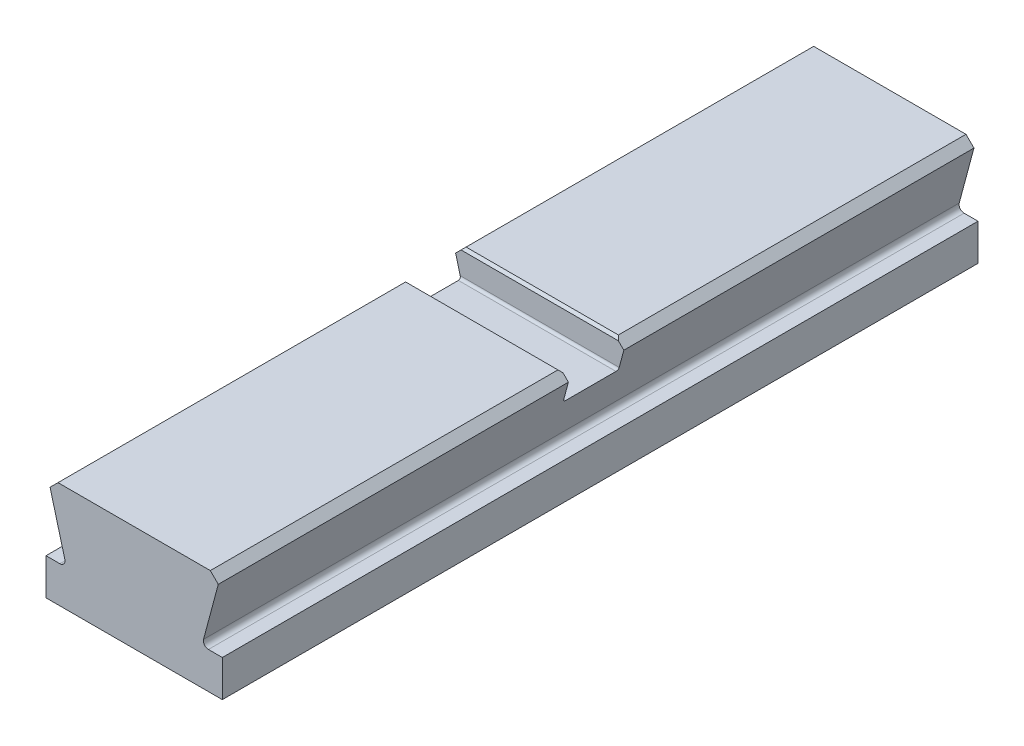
ISO-10303-21;
HEADER;
FILE_DESCRIPTION(('STEP AP214'),'2;1');
FILE_NAME('part.step','',(''),(''),'','','');
FILE_SCHEMA(('AUTOMOTIVE_DESIGN { 1 0 10303 214 1 1 1 1 }'));
ENDSEC;
DATA;
#1=APPLICATION_CONTEXT('core data for automotive mechanical design processes');
#2=APPLICATION_PROTOCOL_DEFINITION('international standard','automotive_design',2000,#1);
#3=PRODUCT_CONTEXT('',#1,'mechanical');
#4=PRODUCT('Part','Part','',(#3));
#5=PRODUCT_RELATED_PRODUCT_CATEGORY('part','',(#4));
#6=PRODUCT_DEFINITION_FORMATION('','',#4);
#7=PRODUCT_DEFINITION_CONTEXT('part definition',#1,'design');
#8=PRODUCT_DEFINITION('design','',#6,#7);
#9=PRODUCT_DEFINITION_SHAPE('','',#8);
#10=(LENGTH_UNIT() NAMED_UNIT(*) SI_UNIT(.MILLI.,.METRE.));
#11=(NAMED_UNIT(*) PLANE_ANGLE_UNIT() SI_UNIT($,.RADIAN.));
#12=(NAMED_UNIT(*) SI_UNIT($,.STERADIAN.) SOLID_ANGLE_UNIT());
#13=UNCERTAINTY_MEASURE_WITH_UNIT(LENGTH_MEASURE(1.E-05),#10,'distance_accuracy_value','');
#14=(GEOMETRIC_REPRESENTATION_CONTEXT(3) GLOBAL_UNCERTAINTY_ASSIGNED_CONTEXT((#13)) GLOBAL_UNIT_ASSIGNED_CONTEXT((#10,
#11,#12)) REPRESENTATION_CONTEXT('',''));
#15=CARTESIAN_POINT('',(0.,0.,0.));
#16=DIRECTION('',(0.,0.,1.));
#17=DIRECTION('',(1.,0.,0.));
#18=AXIS2_PLACEMENT_3D('',#15,#16,#17);
#19=CARTESIAN_POINT('',(-34.2346281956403,0.,-150.));
#20=DIRECTION('',(0.,1.,0.));
#21=DIRECTION('',(-1.,0.,0.));
#22=AXIS2_PLACEMENT_3D('',#19,#20,#21);
#23=PLANE('',#22);
#24=DIRECTION('',(-1.,0.,0.));
#25=VECTOR('',#24,1.);
#26=CARTESIAN_POINT('',(-34.2346281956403,0.,12.));
#27=LINE('',#26,#25);
#28=CARTESIAN_POINT('',(30.2346281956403,0.,12.));
#29=VERTEX_POINT('',#28);
#30=CARTESIAN_POINT('',(-30.2346281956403,0.,12.));
#31=VERTEX_POINT('',#30);
#32=EDGE_CURVE('E286',#29,#31,#27,.T.);
#33=ORIENTED_EDGE('',*,*,#32,.T.);
#34=DIRECTION('',(0.,0.,1.));
#35=VECTOR('',#34,1.);
#36=CARTESIAN_POINT('',(-30.2346281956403,0.,-150.));
#37=LINE('',#36,#35);
#38=CARTESIAN_POINT('',(-30.2346281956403,0.,150.));
#39=VERTEX_POINT('',#38);
#40=EDGE_CURVE('E336',#31,#39,#37,.T.);
#41=ORIENTED_EDGE('',*,*,#40,.T.);
#42=DIRECTION('',(-1.,0.,0.));
#43=VECTOR('',#42,1.);
#44=CARTESIAN_POINT('',(-34.2346281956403,0.,150.));
#45=LINE('',#44,#43);
#46=CARTESIAN_POINT('',(30.2346281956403,0.,150.));
#47=VERTEX_POINT('',#46);
#48=EDGE_CURVE('E224',#47,#39,#45,.T.);
#49=ORIENTED_EDGE('',*,*,#48,.F.);
#50=DIRECTION('',(0.,0.,-1.));
#51=VECTOR('',#50,1.);
#52=CARTESIAN_POINT('',(30.2346281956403,0.,-150.));
#53=LINE('',#52,#51);
#54=EDGE_CURVE('E334',#47,#29,#53,.T.);
#55=ORIENTED_EDGE('',*,*,#54,.T.);
#56=EDGE_LOOP('',(#33,#41,#49,#55));
#57=FACE_BOUND('',#56,.T.);
#58=ADVANCED_FACE('F35',(#57),#23,.T.);
#59=CARTESIAN_POINT('',(-34.2346281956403,0.,-150.));
#60=DIRECTION('',(-0.965925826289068,-0.25881904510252,0.));
#61=DIRECTION('',(0.25881904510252,-0.965925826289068,0.));
#62=AXIS2_PLACEMENT_3D('',#59,#60,#61);
#63=PLANE('',#62);
#64=DIRECTION('',(0.25881904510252,-0.965925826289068,0.));
#65=VECTOR('',#64,1.);
#66=CARTESIAN_POINT('',(-34.2346281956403,0.,-11.));
#67=LINE('',#66,#65);
#68=CARTESIAN_POINT('',(-33.3893287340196,-3.15470053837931,-11.));
#69=VERTEX_POINT('',#68);
#70=CARTESIAN_POINT('',(-31.5551362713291,-10.,-11.));
#71=VERTEX_POINT('',#70);
#72=EDGE_CURVE('E370',#69,#71,#67,.T.);
#73=ORIENTED_EDGE('',*,*,#72,.F.);
#74=DIRECTION('',(0.,0.,-1.));
#75=VECTOR('',#74,1.);
#76=CARTESIAN_POINT('',(-33.3893287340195,-3.1547005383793,-150.));
#77=LINE('',#76,#75);
#78=CARTESIAN_POINT('',(-33.3893287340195,-3.1547005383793,-150.));
#79=VERTEX_POINT('',#78);
#80=EDGE_CURVE('E332',#69,#79,#77,.T.);
#81=ORIENTED_EDGE('',*,*,#80,.T.);
#82=DIRECTION('',(0.25881904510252,-0.965925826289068,0.));
#83=VECTOR('',#82,1.);
#84=CARTESIAN_POINT('',(-34.2346281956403,0.,-150.));
#85=LINE('',#84,#83);
#86=CARTESIAN_POINT('',(-27.5406244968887,-24.982361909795,-150.));
#87=VERTEX_POINT('',#86);
#88=EDGE_CURVE('E226',#79,#87,#85,.T.);
#89=ORIENTED_EDGE('',*,*,#88,.T.);
#90=DIRECTION('',(0.,0.,1.));
#91=VECTOR('',#90,1.);
#92=CARTESIAN_POINT('',(-27.5406244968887,-24.982361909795,150.));
#93=LINE('',#92,#91);
#94=CARTESIAN_POINT('',(-27.5406244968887,-24.982361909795,150.));
#95=VERTEX_POINT('',#94);
#96=EDGE_CURVE('E289',#87,#95,#93,.T.);
#97=ORIENTED_EDGE('',*,*,#96,.T.);
#98=DIRECTION('',(0.25881904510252,-0.965925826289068,0.));
#99=VECTOR('',#98,1.);
#100=CARTESIAN_POINT('',(-34.2346281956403,0.,150.));
#101=LINE('',#100,#99);
#102=CARTESIAN_POINT('',(-33.3893287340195,-3.15470053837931,150.));
#103=VERTEX_POINT('',#102);
#104=EDGE_CURVE('E196',#103,#95,#101,.T.);
#105=ORIENTED_EDGE('',*,*,#104,.F.);
#106=DIRECTION('',(0.,0.,-1.));
#107=VECTOR('',#106,1.);
#108=CARTESIAN_POINT('',(-33.3893287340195,-3.1547005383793,-150.));
#109=LINE('',#108,#107);
#110=CARTESIAN_POINT('',(-33.3893287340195,-3.1547005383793,11.));
#111=VERTEX_POINT('',#110);
#112=EDGE_CURVE('E330',#103,#111,#109,.T.);
#113=ORIENTED_EDGE('',*,*,#112,.T.);
#114=DIRECTION('',(-0.25881904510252,0.965925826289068,0.));
#115=VECTOR('',#114,1.);
#116=CARTESIAN_POINT('',(-34.2346281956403,0.,11.));
#117=LINE('',#116,#115);
#118=CARTESIAN_POINT('',(-31.5551362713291,-10.,11.));
#119=VERTEX_POINT('',#118);
#120=EDGE_CURVE('E369',#119,#111,#117,.T.);
#121=ORIENTED_EDGE('',*,*,#120,.F.);
#122=CARTESIAN_POINT('',(-31.5551362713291,-10.,10.));
#123=DIRECTION('',(-0.965925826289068,-0.25881904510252,0.));
#124=DIRECTION('',(-0.25881904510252,0.965925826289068,0.));
#125=AXIS2_PLACEMENT_3D('',#122,#123,#124);
#126=ELLIPSE('',#125,1.03527618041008,1.);
#127=CARTESIAN_POINT('',(-31.287187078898,-11.,10.));
#128=VERTEX_POINT('',#127);
#129=EDGE_CURVE('E276',#119,#128,#126,.F.);
#130=ORIENTED_EDGE('',*,*,#129,.T.);
#131=DIRECTION('',(0.,0.,1.));
#132=VECTOR('',#131,1.);
#133=CARTESIAN_POINT('',(-31.287187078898,-11.,-150.));
#134=LINE('',#133,#132);
#135=CARTESIAN_POINT('',(-31.287187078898,-11.,-10.));
#136=VERTEX_POINT('',#135);
#137=EDGE_CURVE('E374',#136,#128,#134,.T.);
#138=ORIENTED_EDGE('',*,*,#137,.F.);
#139=CARTESIAN_POINT('',(-31.5551362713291,-10.,-10.));
#140=DIRECTION('',(-0.965925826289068,-0.25881904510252,0.));
#141=DIRECTION('',(-0.25881904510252,0.965925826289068,0.));
#142=AXIS2_PLACEMENT_3D('',#139,#140,#141);
#143=ELLIPSE('',#142,1.03527618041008,1.);
#144=EDGE_CURVE('E270',#136,#71,#143,.F.);
#145=ORIENTED_EDGE('',*,*,#144,.T.);
#146=EDGE_LOOP('',(#73,#81,#89,#97,#105,#113,#121,#130,#138,#145));
#147=FACE_BOUND('',#146,.T.);
#148=ADVANCED_FACE('F366',(#147),#63,.T.);
#149=DIRECTION('',(1.,0.,0.));
#150=VECTOR('',#149,1.);
#151=CARTESIAN_POINT('',(34.2346281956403,0.,-12.));
#152=LINE('',#151,#150);
#153=CARTESIAN_POINT('',(-30.2346281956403,0.,-12.));
#154=VERTEX_POINT('',#153);
#155=CARTESIAN_POINT('',(30.2346281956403,0.,-12.));
#156=VERTEX_POINT('',#155);
#157=EDGE_CURVE('E278',#154,#156,#152,.T.);
#158=ORIENTED_EDGE('',*,*,#157,.T.);
#159=DIRECTION('',(0.,0.,-1.));
#160=VECTOR('',#159,1.);
#161=CARTESIAN_POINT('',(30.2346281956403,0.,-150.));
#162=LINE('',#161,#160);
#163=CARTESIAN_POINT('',(30.2346281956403,0.,-150.));
#164=VERTEX_POINT('',#163);
#165=EDGE_CURVE('E324',#156,#164,#162,.T.);
#166=ORIENTED_EDGE('',*,*,#165,.T.);
#167=DIRECTION('',(-1.,0.,0.));
#168=VECTOR('',#167,1.);
#169=CARTESIAN_POINT('',(-34.2346281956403,0.,-150.));
#170=LINE('',#169,#168);
#171=CARTESIAN_POINT('',(-30.2346281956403,0.,-150.));
#172=VERTEX_POINT('',#171);
#173=EDGE_CURVE('E207',#164,#172,#170,.T.);
#174=ORIENTED_EDGE('',*,*,#173,.T.);
#175=DIRECTION('',(0.,0.,1.));
#176=VECTOR('',#175,1.);
#177=CARTESIAN_POINT('',(-30.2346281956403,0.,-150.));
#178=LINE('',#177,#176);
#179=EDGE_CURVE('E321',#172,#154,#178,.T.);
#180=ORIENTED_EDGE('',*,*,#179,.T.);
#181=EDGE_LOOP('',(#158,#166,#174,#180));
#182=FACE_BOUND('',#181,.T.);
#183=ADVANCED_FACE('F400',(#182),#23,.T.);
#184=CARTESIAN_POINT('',(34.2346281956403,0.,-150.));
#185=DIRECTION('',(0.965925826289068,-0.258819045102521,0.));
#186=DIRECTION('',(0.258819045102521,0.965925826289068,0.));
#187=AXIS2_PLACEMENT_3D('',#184,#185,#186);
#188=PLANE('',#187);
#189=DIRECTION('',(0.258819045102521,0.965925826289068,0.));
#190=VECTOR('',#189,1.);
#191=CARTESIAN_POINT('',(34.2346281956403,0.,-150.));
#192=LINE('',#191,#190);
#193=CARTESIAN_POINT('',(27.5406244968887,-24.982361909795,-150.));
#194=VERTEX_POINT('',#193);
#195=CARTESIAN_POINT('',(33.3893287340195,-3.15470053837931,-150.));
#196=VERTEX_POINT('',#195);
#197=EDGE_CURVE('E240',#194,#196,#192,.T.);
#198=ORIENTED_EDGE('',*,*,#197,.T.);
#199=DIRECTION('',(0.,0.,1.));
#200=VECTOR('',#199,1.);
#201=CARTESIAN_POINT('',(33.3893287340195,-3.15470053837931,-150.));
#202=LINE('',#201,#200);
#203=CARTESIAN_POINT('',(33.3893287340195,-3.1547005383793,-11.));
#204=VERTEX_POINT('',#203);
#205=EDGE_CURVE('E310',#196,#204,#202,.T.);
#206=ORIENTED_EDGE('',*,*,#205,.T.);
#207=DIRECTION('',(0.258819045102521,0.965925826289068,0.));
#208=VECTOR('',#207,1.);
#209=CARTESIAN_POINT('',(34.2346281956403,0.,-11.));
#210=LINE('',#209,#208);
#211=CARTESIAN_POINT('',(31.5551362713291,-10.,-11.));
#212=VERTEX_POINT('',#211);
#213=EDGE_CURVE('E253',#212,#204,#210,.T.);
#214=ORIENTED_EDGE('',*,*,#213,.F.);
#215=CARTESIAN_POINT('',(31.5551362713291,-10.,-10.));
#216=DIRECTION('',(0.965925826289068,-0.258819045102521,0.));
#217=DIRECTION('',(-0.258819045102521,-0.965925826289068,0.));
#218=AXIS2_PLACEMENT_3D('',#215,#216,#217);
#219=ELLIPSE('',#218,1.03527618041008,1.);
#220=CARTESIAN_POINT('',(31.287187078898,-11.,-10.));
#221=VERTEX_POINT('',#220);
#222=EDGE_CURVE('E268',#212,#221,#219,.F.);
#223=ORIENTED_EDGE('',*,*,#222,.T.);
#224=DIRECTION('',(0.,0.,-1.));
#225=VECTOR('',#224,1.);
#226=CARTESIAN_POINT('',(31.287187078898,-11.,-150.));
#227=LINE('',#226,#225);
#228=CARTESIAN_POINT('',(31.287187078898,-11.,10.));
#229=VERTEX_POINT('',#228);
#230=EDGE_CURVE('E247',#229,#221,#227,.T.);
#231=ORIENTED_EDGE('',*,*,#230,.F.);
#232=CARTESIAN_POINT('',(31.5551362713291,-10.,10.));
#233=DIRECTION('',(0.965925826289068,-0.258819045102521,0.));
#234=DIRECTION('',(-0.258819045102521,-0.965925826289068,0.));
#235=AXIS2_PLACEMENT_3D('',#232,#233,#234);
#236=ELLIPSE('',#235,1.03527618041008,1.);
#237=CARTESIAN_POINT('',(31.5551362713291,-10.,11.));
#238=VERTEX_POINT('',#237);
#239=EDGE_CURVE('E273',#229,#238,#236,.F.);
#240=ORIENTED_EDGE('',*,*,#239,.T.);
#241=DIRECTION('',(-0.258819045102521,-0.965925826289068,0.));
#242=VECTOR('',#241,1.);
#243=CARTESIAN_POINT('',(34.2346281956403,0.,11.));
#244=LINE('',#243,#242);
#245=CARTESIAN_POINT('',(33.3893287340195,-3.1547005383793,11.));
#246=VERTEX_POINT('',#245);
#247=EDGE_CURVE('E256',#246,#238,#244,.T.);
#248=ORIENTED_EDGE('',*,*,#247,.F.);
#249=DIRECTION('',(0.,0.,1.));
#250=VECTOR('',#249,1.);
#251=CARTESIAN_POINT('',(33.3893287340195,-3.15470053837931,-150.));
#252=LINE('',#251,#250);
#253=CARTESIAN_POINT('',(33.3893287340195,-3.1547005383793,150.));
#254=VERTEX_POINT('',#253);
#255=EDGE_CURVE('E307',#246,#254,#252,.T.);
#256=ORIENTED_EDGE('',*,*,#255,.T.);
#257=DIRECTION('',(0.258819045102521,0.965925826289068,0.));
#258=VECTOR('',#257,1.);
#259=CARTESIAN_POINT('',(34.2346281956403,0.,150.));
#260=LINE('',#259,#258);
#261=CARTESIAN_POINT('',(27.5406244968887,-24.982361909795,150.));
#262=VERTEX_POINT('',#261);
#263=EDGE_CURVE('E221',#262,#254,#260,.T.);
#264=ORIENTED_EDGE('',*,*,#263,.F.);
#265=DIRECTION('',(0.,0.,1.));
#266=VECTOR('',#265,1.);
#267=CARTESIAN_POINT('',(27.5406244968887,-24.982361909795,-150.));
#268=LINE('',#267,#266);
#269=EDGE_CURVE('E297',#262,#194,#268,.F.);
#270=ORIENTED_EDGE('',*,*,#269,.T.);
#271=EDGE_LOOP('',(#198,#206,#214,#223,#231,#240,#248,#256,#264,#270));
#272=FACE_BOUND('',#271,.T.);
#273=ADVANCED_FACE('F351',(#272),#188,.T.);
#274=CARTESIAN_POINT('',(35.,-27.5,-150.));
#275=DIRECTION('',(0.,1.,0.));
#276=DIRECTION('',(-1.,0.,0.));
#277=AXIS2_PLACEMENT_3D('',#274,#275,#276);
#278=PLANE('',#277);
#279=DIRECTION('',(-1.,0.,0.));
#280=VECTOR('',#279,1.);
#281=CARTESIAN_POINT('',(35.,-27.5,-150.));
#282=LINE('',#281,#280);
#283=CARTESIAN_POINT('',(35.,-27.5,-150.));
#284=VERTEX_POINT('',#283);
#285=CARTESIAN_POINT('',(29.4724761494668,-27.5,-150.));
#286=VERTEX_POINT('',#285);
#287=EDGE_CURVE('E237',#284,#286,#282,.T.);
#288=ORIENTED_EDGE('',*,*,#287,.T.);
#289=DIRECTION('',(0.,0.,1.));
#290=VECTOR('',#289,1.);
#291=CARTESIAN_POINT('',(29.4724761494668,-27.5,150.));
#292=LINE('',#291,#290);
#293=CARTESIAN_POINT('',(29.4724761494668,-27.5,150.));
#294=VERTEX_POINT('',#293);
#295=EDGE_CURVE('E294',#286,#294,#292,.T.);
#296=ORIENTED_EDGE('',*,*,#295,.T.);
#297=DIRECTION('',(-1.,0.,0.));
#298=VECTOR('',#297,1.);
#299=CARTESIAN_POINT('',(35.,-27.5,150.));
#300=LINE('',#299,#298);
#301=CARTESIAN_POINT('',(35.,-27.5,150.));
#302=VERTEX_POINT('',#301);
#303=EDGE_CURVE('E218',#302,#294,#300,.T.);
#304=ORIENTED_EDGE('',*,*,#303,.F.);
#305=DIRECTION('',(0.,0.,1.));
#306=VECTOR('',#305,1.);
#307=CARTESIAN_POINT('',(35.,-27.5,-150.));
#308=LINE('',#307,#306);
#309=EDGE_CURVE('E245',#284,#302,#308,.T.);
#310=ORIENTED_EDGE('',*,*,#309,.F.);
#311=EDGE_LOOP('',(#288,#296,#304,#310));
#312=FACE_BOUND('',#311,.T.);
#313=ADVANCED_FACE('F412',(#312),#278,.T.);
#314=CARTESIAN_POINT('',(35.,-42.,-150.));
#315=DIRECTION('',(1.,0.,0.));
#316=DIRECTION('',(0.,0.,-1.));
#317=AXIS2_PLACEMENT_3D('',#314,#315,#316);
#318=PLANE('',#317);
#319=ORIENTED_EDGE('',*,*,#309,.T.);
#320=DIRECTION('',(0.,1.,0.));
#321=VECTOR('',#320,1.);
#322=CARTESIAN_POINT('',(35.,-42.,150.));
#323=LINE('',#322,#321);
#324=CARTESIAN_POINT('',(35.,-42.,150.));
#325=VERTEX_POINT('',#324);
#326=EDGE_CURVE('E212',#325,#302,#323,.T.);
#327=ORIENTED_EDGE('',*,*,#326,.F.);
#328=DIRECTION('',(0.,0.,1.));
#329=VECTOR('',#328,1.);
#330=CARTESIAN_POINT('',(35.,-42.,-150.));
#331=LINE('',#330,#329);
#332=CARTESIAN_POINT('',(35.,-42.,-150.));
#333=VERTEX_POINT('',#332);
#334=EDGE_CURVE('E248',#333,#325,#331,.T.);
#335=ORIENTED_EDGE('',*,*,#334,.F.);
#336=DIRECTION('',(0.,1.,0.));
#337=VECTOR('',#336,1.);
#338=CARTESIAN_POINT('',(35.,-42.,-150.));
#339=LINE('',#338,#337);
#340=EDGE_CURVE('E234',#333,#284,#339,.T.);
#341=ORIENTED_EDGE('',*,*,#340,.T.);
#342=EDGE_LOOP('',(#319,#327,#335,#341));
#343=FACE_BOUND('',#342,.T.);
#344=ADVANCED_FACE('F437',(#343),#318,.T.);
#345=CARTESIAN_POINT('',(-35.,-42.,-150.));
#346=DIRECTION('',(0.,-1.,0.));
#347=DIRECTION('',(1.,0.,0.));
#348=AXIS2_PLACEMENT_3D('',#345,#346,#347);
#349=PLANE('',#348);
#350=ORIENTED_EDGE('',*,*,#334,.T.);
#351=DIRECTION('',(1.,0.,0.));
#352=VECTOR('',#351,1.);
#353=CARTESIAN_POINT('',(-35.,-42.,150.));
#354=LINE('',#353,#352);
#355=CARTESIAN_POINT('',(-35.,-42.,150.));
#356=VERTEX_POINT('',#355);
#357=EDGE_CURVE('E210',#356,#325,#354,.T.);
#358=ORIENTED_EDGE('',*,*,#357,.F.);
#359=DIRECTION('',(0.,0.,1.));
#360=VECTOR('',#359,1.);
#361=CARTESIAN_POINT('',(-35.,-42.,-150.));
#362=LINE('',#361,#360);
#363=CARTESIAN_POINT('',(-35.,-42.,-150.));
#364=VERTEX_POINT('',#363);
#365=EDGE_CURVE('E206',#364,#356,#362,.T.);
#366=ORIENTED_EDGE('',*,*,#365,.F.);
#367=DIRECTION('',(1.,0.,0.));
#368=VECTOR('',#367,1.);
#369=CARTESIAN_POINT('',(-35.,-42.,-150.));
#370=LINE('',#369,#368);
#371=EDGE_CURVE('E231',#364,#333,#370,.T.);
#372=ORIENTED_EDGE('',*,*,#371,.T.);
#373=EDGE_LOOP('',(#350,#358,#366,#372));
#374=FACE_BOUND('',#373,.T.);
#375=ADVANCED_FACE('F439',(#374),#349,.T.);
#376=CARTESIAN_POINT('',(-35.,-27.5,-150.));
#377=DIRECTION('',(-1.,0.,0.));
#378=DIRECTION('',(0.,-1.,0.));
#379=AXIS2_PLACEMENT_3D('',#376,#377,#378);
#380=PLANE('',#379);
#381=ORIENTED_EDGE('',*,*,#365,.T.);
#382=DIRECTION('',(0.,-1.,0.));
#383=VECTOR('',#382,1.);
#384=CARTESIAN_POINT('',(-35.,-27.5,150.));
#385=LINE('',#384,#383);
#386=CARTESIAN_POINT('',(-35.,-27.5,150.));
#387=VERTEX_POINT('',#386);
#388=EDGE_CURVE('E190',#387,#356,#385,.T.);
#389=ORIENTED_EDGE('',*,*,#388,.F.);
#390=DIRECTION('',(0.,0.,1.));
#391=VECTOR('',#390,1.);
#392=CARTESIAN_POINT('',(-35.,-27.5,-150.));
#393=LINE('',#392,#391);
#394=CARTESIAN_POINT('',(-35.,-27.5,-150.));
#395=VERTEX_POINT('',#394);
#396=EDGE_CURVE('E199',#395,#387,#393,.T.);
#397=ORIENTED_EDGE('',*,*,#396,.F.);
#398=DIRECTION('',(0.,-1.,0.));
#399=VECTOR('',#398,1.);
#400=CARTESIAN_POINT('',(-35.,-27.5,-150.));
#401=LINE('',#400,#399);
#402=EDGE_CURVE('E229',#395,#364,#401,.T.);
#403=ORIENTED_EDGE('',*,*,#402,.T.);
#404=EDGE_LOOP('',(#381,#389,#397,#403));
#405=FACE_BOUND('',#404,.T.);
#406=ADVANCED_FACE('F209',(#405),#380,.T.);
#407=CARTESIAN_POINT('',(-26.8660254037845,-27.5,-150.));
#408=DIRECTION('',(0.,1.,0.));
#409=DIRECTION('',(-1.,0.,0.));
#410=AXIS2_PLACEMENT_3D('',#407,#408,#409);
#411=PLANE('',#410);
#412=DIRECTION('',(-1.,0.,0.));
#413=VECTOR('',#412,1.);
#414=CARTESIAN_POINT('',(-26.8660254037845,-27.5,150.));
#415=LINE('',#414,#413);
#416=CARTESIAN_POINT('',(-29.4724761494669,-27.5,150.));
#417=VERTEX_POINT('',#416);
#418=EDGE_CURVE('E184',#417,#387,#415,.T.);
#419=ORIENTED_EDGE('',*,*,#418,.F.);
#420=DIRECTION('',(0.,0.,1.));
#421=VECTOR('',#420,1.);
#422=CARTESIAN_POINT('',(-29.4724761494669,-27.5,-150.));
#423=LINE('',#422,#421);
#424=CARTESIAN_POINT('',(-29.4724761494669,-27.5,-150.));
#425=VERTEX_POINT('',#424);
#426=EDGE_CURVE('E292',#417,#425,#423,.F.);
#427=ORIENTED_EDGE('',*,*,#426,.T.);
#428=DIRECTION('',(-1.,0.,0.));
#429=VECTOR('',#428,1.);
#430=CARTESIAN_POINT('',(-26.8660254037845,-27.5,-150.));
#431=LINE('',#430,#429);
#432=EDGE_CURVE('E202',#425,#395,#431,.T.);
#433=ORIENTED_EDGE('',*,*,#432,.T.);
#434=ORIENTED_EDGE('',*,*,#396,.T.);
#435=EDGE_LOOP('',(#419,#427,#433,#434));
#436=FACE_BOUND('',#435,.T.);
#437=ADVANCED_FACE('F200',(#436),#411,.T.);
#438=CARTESIAN_POINT('',(0.,0.,-150.));
#439=DIRECTION('',(0.,0.,-1.));
#440=DIRECTION('',(-1.,0.,0.));
#441=AXIS2_PLACEMENT_3D('',#438,#439,#440);
#442=PLANE('',#441);
#443=ORIENTED_EDGE('',*,*,#173,.F.);
#444=DIRECTION('',(-0.707106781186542,0.707106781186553,0.));
#445=VECTOR('',#444,1.);
#446=CARTESIAN_POINT('',(15.1173140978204,15.1173140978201,-150.));
#447=LINE('',#446,#445);
#448=EDGE_CURVE('E328',#164,#196,#447,.F.);
#449=ORIENTED_EDGE('',*,*,#448,.T.);
#450=ORIENTED_EDGE('',*,*,#197,.F.);
#451=CARTESIAN_POINT('',(29.4724761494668,-25.5,-150.));
#452=DIRECTION('',(0.,0.,-1.));
#453=DIRECTION('',(-1.,0.,0.));
#454=AXIS2_PLACEMENT_3D('',#451,#452,#453);
#455=CIRCLE('',#454,2.);
#456=EDGE_CURVE('E305',#194,#286,#455,.F.);
#457=ORIENTED_EDGE('',*,*,#456,.T.);
#458=ORIENTED_EDGE('',*,*,#287,.F.);
#459=ORIENTED_EDGE('',*,*,#340,.F.);
#460=ORIENTED_EDGE('',*,*,#371,.F.);
#461=ORIENTED_EDGE('',*,*,#402,.F.);
#462=ORIENTED_EDGE('',*,*,#432,.F.);
#463=CARTESIAN_POINT('',(-29.4724761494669,-25.5,-150.));
#464=DIRECTION('',(0.,0.,-1.));
#465=DIRECTION('',(-1.,0.,0.));
#466=AXIS2_PLACEMENT_3D('',#463,#464,#465);
#467=CIRCLE('',#466,2.);
#468=EDGE_CURVE('E300',#425,#87,#467,.F.);
#469=ORIENTED_EDGE('',*,*,#468,.T.);
#470=ORIENTED_EDGE('',*,*,#88,.F.);
#471=DIRECTION('',(-0.707106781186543,-0.707106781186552,0.));
#472=VECTOR('',#471,1.);
#473=CARTESIAN_POINT('',(-15.1173140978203,15.1173140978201,-150.));
#474=LINE('',#473,#472);
#475=EDGE_CURVE('E326',#79,#172,#474,.F.);
#476=ORIENTED_EDGE('',*,*,#475,.T.);
#477=EDGE_LOOP('',(#443,#449,#450,#457,#458,#459,#460,#461,#462,#469,#470,#476));
#478=FACE_BOUND('',#477,.T.);
#479=ADVANCED_FACE('F424',(#478),#442,.T.);
#480=CARTESIAN_POINT('',(0.,0.,150.));
#481=DIRECTION('',(0.,0.,-1.));
#482=DIRECTION('',(-1.,0.,0.));
#483=AXIS2_PLACEMENT_3D('',#480,#481,#482);
#484=PLANE('',#483);
#485=ORIENTED_EDGE('',*,*,#48,.T.);
#486=DIRECTION('',(0.707106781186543,0.707106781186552,0.));
#487=VECTOR('',#486,1.);
#488=CARTESIAN_POINT('',(-30.2346281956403,0.,150.));
#489=LINE('',#488,#487);
#490=EDGE_CURVE('E341',#39,#103,#489,.F.);
#491=ORIENTED_EDGE('',*,*,#490,.T.);
#492=ORIENTED_EDGE('',*,*,#104,.T.);
#493=CARTESIAN_POINT('',(-29.4724761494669,-25.5,150.));
#494=DIRECTION('',(0.,0.,-1.));
#495=DIRECTION('',(-1.,0.,0.));
#496=AXIS2_PLACEMENT_3D('',#493,#494,#495);
#497=CIRCLE('',#496,2.);
#498=EDGE_CURVE('E193',#95,#417,#497,.T.);
#499=ORIENTED_EDGE('',*,*,#498,.T.);
#500=ORIENTED_EDGE('',*,*,#418,.T.);
#501=ORIENTED_EDGE('',*,*,#388,.T.);
#502=ORIENTED_EDGE('',*,*,#357,.T.);
#503=ORIENTED_EDGE('',*,*,#326,.T.);
#504=ORIENTED_EDGE('',*,*,#303,.T.);
#505=CARTESIAN_POINT('',(29.4724761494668,-25.5,150.));
#506=DIRECTION('',(0.,0.,-1.));
#507=DIRECTION('',(-1.,0.,0.));
#508=AXIS2_PLACEMENT_3D('',#505,#506,#507);
#509=CIRCLE('',#508,2.);
#510=EDGE_CURVE('E303',#294,#262,#509,.T.);
#511=ORIENTED_EDGE('',*,*,#510,.T.);
#512=ORIENTED_EDGE('',*,*,#263,.T.);
#513=DIRECTION('',(0.707106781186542,-0.707106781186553,0.));
#514=VECTOR('',#513,1.);
#515=CARTESIAN_POINT('',(33.3893287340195,-3.1547005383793,150.));
#516=LINE('',#515,#514);
#517=EDGE_CURVE('E339',#254,#47,#516,.F.);
#518=ORIENTED_EDGE('',*,*,#517,.T.);
#519=EDGE_LOOP('',(#485,#491,#492,#499,#500,#501,#502,#503,#504,#511,#512,#518));
#520=FACE_BOUND('',#519,.T.);
#521=ADVANCED_FACE('F187',(#520),#484,.F.);
#522=CARTESIAN_POINT('',(-35.,0.,11.));
#523=DIRECTION('',(0.,0.,1.));
#524=DIRECTION('',(0.,-1.,0.));
#525=AXIS2_PLACEMENT_3D('',#522,#523,#524);
#526=PLANE('',#525);
#527=ORIENTED_EDGE('',*,*,#120,.T.);
#528=DIRECTION('',(-0.707106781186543,-0.707106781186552,0.));
#529=VECTOR('',#528,1.);
#530=CARTESIAN_POINT('',(-30.2346281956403,0.,11.));
#531=LINE('',#530,#529);
#532=CARTESIAN_POINT('',(-31.2346281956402,-0.999999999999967,11.));
#533=VERTEX_POINT('',#532);
#534=EDGE_CURVE('E56',#111,#533,#531,.F.);
#535=ORIENTED_EDGE('',*,*,#534,.T.);
#536=DIRECTION('',(1.,0.,0.));
#537=VECTOR('',#536,1.);
#538=CARTESIAN_POINT('',(34.2346281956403,-0.999999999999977,11.));
#539=LINE('',#538,#537);
#540=CARTESIAN_POINT('',(31.2346281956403,-0.999999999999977,11.));
#541=VERTEX_POINT('',#540);
#542=EDGE_CURVE('E284',#533,#541,#539,.T.);
#543=ORIENTED_EDGE('',*,*,#542,.T.);
#544=DIRECTION('',(-0.707106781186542,0.707106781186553,0.));
#545=VECTOR('',#544,1.);
#546=CARTESIAN_POINT('',(33.3893287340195,-3.15470053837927,11.));
#547=LINE('',#546,#545);
#548=EDGE_CURVE('E343',#541,#246,#547,.F.);
#549=ORIENTED_EDGE('',*,*,#548,.T.);
#550=ORIENTED_EDGE('',*,*,#247,.T.);
#551=DIRECTION('',(1.,0.,0.));
#552=VECTOR('',#551,1.);
#553=CARTESIAN_POINT('',(-31.287187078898,-10.,11.));
#554=LINE('',#553,#552);
#555=EDGE_CURVE('E266',#238,#119,#554,.F.);
#556=ORIENTED_EDGE('',*,*,#555,.T.);
#557=EDGE_LOOP('',(#527,#535,#543,#549,#550,#556));
#558=FACE_BOUND('',#557,.T.);
#559=ADVANCED_FACE('F347',(#558),#526,.F.);
#560=CARTESIAN_POINT('',(-35.,0.,-11.));
#561=DIRECTION('',(0.,0.,-1.));
#562=DIRECTION('',(0.,1.,0.));
#563=AXIS2_PLACEMENT_3D('',#560,#561,#562);
#564=PLANE('',#563);
#565=ORIENTED_EDGE('',*,*,#213,.T.);
#566=DIRECTION('',(0.707106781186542,-0.707106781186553,0.));
#567=VECTOR('',#566,1.);
#568=CARTESIAN_POINT('',(33.3893287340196,-3.15470053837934,-11.));
#569=LINE('',#568,#567);
#570=CARTESIAN_POINT('',(31.2346281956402,-0.999999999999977,-11.));
#571=VERTEX_POINT('',#570);
#572=EDGE_CURVE('E315',#204,#571,#569,.F.);
#573=ORIENTED_EDGE('',*,*,#572,.T.);
#574=DIRECTION('',(-1.,0.,0.));
#575=VECTOR('',#574,1.);
#576=CARTESIAN_POINT('',(-34.2346281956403,-0.999999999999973,-11.));
#577=LINE('',#576,#575);
#578=CARTESIAN_POINT('',(-31.2346281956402,-0.999999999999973,-11.));
#579=VERTEX_POINT('',#578);
#580=EDGE_CURVE('E281',#571,#579,#577,.T.);
#581=ORIENTED_EDGE('',*,*,#580,.T.);
#582=DIRECTION('',(0.707106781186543,0.707106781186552,0.));
#583=VECTOR('',#582,1.);
#584=CARTESIAN_POINT('',(-30.2346281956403,0.,-11.));
#585=LINE('',#584,#583);
#586=EDGE_CURVE('E313',#579,#69,#585,.F.);
#587=ORIENTED_EDGE('',*,*,#586,.T.);
#588=ORIENTED_EDGE('',*,*,#72,.T.);
#589=DIRECTION('',(1.,0.,0.));
#590=VECTOR('',#589,1.);
#591=CARTESIAN_POINT('',(31.287187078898,-10.,-11.));
#592=LINE('',#591,#590);
#593=EDGE_CURVE('E258',#71,#212,#592,.T.);
#594=ORIENTED_EDGE('',*,*,#593,.T.);
#595=EDGE_LOOP('',(#565,#573,#581,#587,#588,#594));
#596=FACE_BOUND('',#595,.T.);
#597=ADVANCED_FACE('F501',(#596),#564,.F.);
#598=CARTESIAN_POINT('',(-35.,-11.,11.));
#599=DIRECTION('',(0.,-1.,0.));
#600=DIRECTION('',(0.,0.,-1.));
#601=AXIS2_PLACEMENT_3D('',#598,#599,#600);
#602=PLANE('',#601);
#603=ORIENTED_EDGE('',*,*,#230,.T.);
#604=DIRECTION('',(1.,0.,0.));
#605=VECTOR('',#604,1.);
#606=CARTESIAN_POINT('',(-31.287187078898,-11.,-10.));
#607=LINE('',#606,#605);
#608=EDGE_CURVE('E264',#221,#136,#607,.F.);
#609=ORIENTED_EDGE('',*,*,#608,.T.);
#610=ORIENTED_EDGE('',*,*,#137,.T.);
#611=DIRECTION('',(1.,0.,0.));
#612=VECTOR('',#611,1.);
#613=CARTESIAN_POINT('',(31.287187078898,-11.,10.));
#614=LINE('',#613,#612);
#615=EDGE_CURVE('E261',#128,#229,#614,.T.);
#616=ORIENTED_EDGE('',*,*,#615,.T.);
#617=EDGE_LOOP('',(#603,#609,#610,#616));
#618=FACE_BOUND('',#617,.T.);
#619=ADVANCED_FACE('F379',(#618),#602,.F.);
#620=CARTESIAN_POINT('',(-35.,-10.,-10.));
#621=DIRECTION('',(-1.,0.,0.));
#622=DIRECTION('',(0.,0.,1.));
#623=AXIS2_PLACEMENT_3D('',#620,#621,#622);
#624=CYLINDRICAL_SURFACE('',#623,1.);
#625=ORIENTED_EDGE('',*,*,#144,.F.);
#626=ORIENTED_EDGE('',*,*,#608,.F.);
#627=ORIENTED_EDGE('',*,*,#222,.F.);
#628=ORIENTED_EDGE('',*,*,#593,.F.);
#629=EDGE_LOOP('',(#625,#626,#627,#628));
#630=FACE_BOUND('',#629,.T.);
#631=ADVANCED_FACE('F387',(#630),#624,.F.);
#632=CARTESIAN_POINT('',(-35.,-10.,10.));
#633=DIRECTION('',(-1.,0.,0.));
#634=DIRECTION('',(0.,0.,1.));
#635=AXIS2_PLACEMENT_3D('',#632,#633,#634);
#636=CYLINDRICAL_SURFACE('',#635,1.);
#637=ORIENTED_EDGE('',*,*,#129,.F.);
#638=ORIENTED_EDGE('',*,*,#555,.F.);
#639=ORIENTED_EDGE('',*,*,#239,.F.);
#640=ORIENTED_EDGE('',*,*,#615,.F.);
#641=EDGE_LOOP('',(#637,#638,#639,#640));
#642=FACE_BOUND('',#641,.T.);
#643=ADVANCED_FACE('F384',(#642),#636,.F.);
#644=CARTESIAN_POINT('',(-34.2346281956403,0.,-12.));
#645=DIRECTION('',(0.,0.707106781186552,0.707106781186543));
#646=DIRECTION('',(-1.,0.,0.));
#647=AXIS2_PLACEMENT_3D('',#644,#645,#646);
#648=PLANE('',#647);
#649=ORIENTED_EDGE('',*,*,#580,.F.);
#650=DIRECTION('',(0.577350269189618,-0.577350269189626,0.577350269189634));
#651=VECTOR('',#650,1.);
#652=CARTESIAN_POINT('',(8.74487606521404,21.4897521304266,-33.4897521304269));
#653=LINE('',#652,#651);
#654=EDGE_CURVE('E319',#571,#156,#653,.F.);
#655=ORIENTED_EDGE('',*,*,#654,.T.);
#656=ORIENTED_EDGE('',*,*,#157,.F.);
#657=DIRECTION('',(0.577350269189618,0.577350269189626,-0.577350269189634));
#658=VECTOR('',#657,1.);
#659=CARTESIAN_POINT('',(-31.5679615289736,-1.33333333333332,-10.6666666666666));
#660=LINE('',#659,#658);
#661=EDGE_CURVE('E317',#154,#579,#660,.F.);
#662=ORIENTED_EDGE('',*,*,#661,.T.);
#663=EDGE_LOOP('',(#649,#655,#656,#662));
#664=FACE_BOUND('',#663,.T.);
#665=ADVANCED_FACE('F386',(#664),#648,.T.);
#666=CARTESIAN_POINT('',(-35.,-0.999999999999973,11.));
#667=DIRECTION('',(0.,0.707106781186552,-0.707106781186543));
#668=DIRECTION('',(-1.,0.,0.));
#669=AXIS2_PLACEMENT_3D('',#666,#667,#668);
#670=PLANE('',#669);
#671=ORIENTED_EDGE('',*,*,#542,.F.);
#672=DIRECTION('',(-0.577350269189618,-0.577350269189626,-0.577350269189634));
#673=VECTOR('',#672,1.);
#674=CARTESIAN_POINT('',(-32.4897521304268,-2.25512393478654,9.74487606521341));
#675=LINE('',#674,#673);
#676=EDGE_CURVE('E11',#533,#31,#675,.F.);
#677=ORIENTED_EDGE('',*,*,#676,.T.);
#678=ORIENTED_EDGE('',*,*,#32,.F.);
#679=DIRECTION('',(-0.577350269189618,0.577350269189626,0.577350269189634));
#680=VECTOR('',#679,1.);
#681=CARTESIAN_POINT('',(9.15641879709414,21.0782093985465,33.0782093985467));
#682=LINE('',#681,#680);
#683=EDGE_CURVE('E43',#29,#541,#682,.F.);
#684=ORIENTED_EDGE('',*,*,#683,.T.);
#685=EDGE_LOOP('',(#671,#677,#678,#684));
#686=FACE_BOUND('',#685,.T.);
#687=ADVANCED_FACE('F393',(#686),#670,.T.);
#688=CARTESIAN_POINT('',(-29.4724761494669,-25.5,-150.));
#689=DIRECTION('',(0.,0.,-1.));
#690=DIRECTION('',(-1.,0.,0.));
#691=AXIS2_PLACEMENT_3D('',#688,#689,#690);
#692=CYLINDRICAL_SURFACE('',#691,2.);
#693=ORIENTED_EDGE('',*,*,#468,.F.);
#694=ORIENTED_EDGE('',*,*,#426,.F.);
#695=ORIENTED_EDGE('',*,*,#498,.F.);
#696=ORIENTED_EDGE('',*,*,#96,.F.);
#697=EDGE_LOOP('',(#693,#694,#695,#696));
#698=FACE_BOUND('',#697,.T.);
#699=ADVANCED_FACE('F444',(#698),#692,.F.);
#700=CARTESIAN_POINT('',(29.4724761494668,-25.5,-150.));
#701=DIRECTION('',(0.,0.,-1.));
#702=DIRECTION('',(-1.,0.,0.));
#703=AXIS2_PLACEMENT_3D('',#700,#701,#702);
#704=CYLINDRICAL_SURFACE('',#703,2.);
#705=ORIENTED_EDGE('',*,*,#456,.F.);
#706=ORIENTED_EDGE('',*,*,#269,.F.);
#707=ORIENTED_EDGE('',*,*,#510,.F.);
#708=ORIENTED_EDGE('',*,*,#295,.F.);
#709=EDGE_LOOP('',(#705,#706,#707,#708));
#710=FACE_BOUND('',#709,.T.);
#711=ADVANCED_FACE('F429',(#710),#704,.F.);
#712=CARTESIAN_POINT('',(33.3893287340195,-3.1547005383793,-150.));
#713=DIRECTION('',(-0.707106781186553,-0.707106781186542,0.));
#714=DIRECTION('',(0.,0.,1.));
#715=AXIS2_PLACEMENT_3D('',#712,#713,#714);
#716=PLANE('',#715);
#717=ORIENTED_EDGE('',*,*,#448,.F.);
#718=ORIENTED_EDGE('',*,*,#165,.F.);
#719=ORIENTED_EDGE('',*,*,#654,.F.);
#720=ORIENTED_EDGE('',*,*,#572,.F.);
#721=ORIENTED_EDGE('',*,*,#205,.F.);
#722=EDGE_LOOP('',(#717,#718,#719,#720,#721));
#723=FACE_BOUND('',#722,.T.);
#724=ADVANCED_FACE('F420',(#723),#716,.F.);
#725=CARTESIAN_POINT('',(-30.2346281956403,0.,-150.));
#726=DIRECTION('',(0.707106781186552,-0.707106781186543,0.));
#727=DIRECTION('',(0.,0.,1.));
#728=AXIS2_PLACEMENT_3D('',#725,#726,#727);
#729=PLANE('',#728);
#730=ORIENTED_EDGE('',*,*,#475,.F.);
#731=ORIENTED_EDGE('',*,*,#80,.F.);
#732=ORIENTED_EDGE('',*,*,#586,.F.);
#733=ORIENTED_EDGE('',*,*,#661,.F.);
#734=ORIENTED_EDGE('',*,*,#179,.F.);
#735=EDGE_LOOP('',(#730,#731,#732,#733,#734));
#736=FACE_BOUND('',#735,.T.);
#737=ADVANCED_FACE('F456',(#736),#729,.F.);
#738=CARTESIAN_POINT('',(-30.2346281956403,0.,-150.));
#739=DIRECTION('',(0.707106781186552,-0.707106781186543,0.));
#740=DIRECTION('',(0.,0.,1.));
#741=AXIS2_PLACEMENT_3D('',#738,#739,#740);
#742=PLANE('',#741);
#743=ORIENTED_EDGE('',*,*,#534,.F.);
#744=ORIENTED_EDGE('',*,*,#112,.F.);
#745=ORIENTED_EDGE('',*,*,#490,.F.);
#746=ORIENTED_EDGE('',*,*,#40,.F.);
#747=ORIENTED_EDGE('',*,*,#676,.F.);
#748=EDGE_LOOP('',(#743,#744,#745,#746,#747));
#749=FACE_BOUND('',#748,.T.);
#750=ADVANCED_FACE('F361',(#749),#742,.F.);
#751=CARTESIAN_POINT('',(33.3893287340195,-3.1547005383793,-150.));
#752=DIRECTION('',(-0.707106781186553,-0.707106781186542,0.));
#753=DIRECTION('',(0.,0.,1.));
#754=AXIS2_PLACEMENT_3D('',#751,#752,#753);
#755=PLANE('',#754);
#756=ORIENTED_EDGE('',*,*,#683,.F.);
#757=ORIENTED_EDGE('',*,*,#54,.F.);
#758=ORIENTED_EDGE('',*,*,#517,.F.);
#759=ORIENTED_EDGE('',*,*,#255,.F.);
#760=ORIENTED_EDGE('',*,*,#548,.F.);
#761=EDGE_LOOP('',(#756,#757,#758,#759,#760));
#762=FACE_BOUND('',#761,.T.);
#763=ADVANCED_FACE('F37',(#762),#755,.F.);
#764=CLOSED_SHELL('',(#58,#148,#183,#273,#313,#344,#375,#406,#437,#479,#521,#559,#597,#619,#631,
#643,#665,#687,#699,#711,#724,#737,#750,#763));
#765=MANIFOLD_SOLID_BREP('B2',#764);
#766=ADVANCED_BREP_SHAPE_REPRESENTATION('',(#18,#765),#14);
#767=SHAPE_DEFINITION_REPRESENTATION(#9,#766);
ENDSEC;
END-ISO-10303-21;
